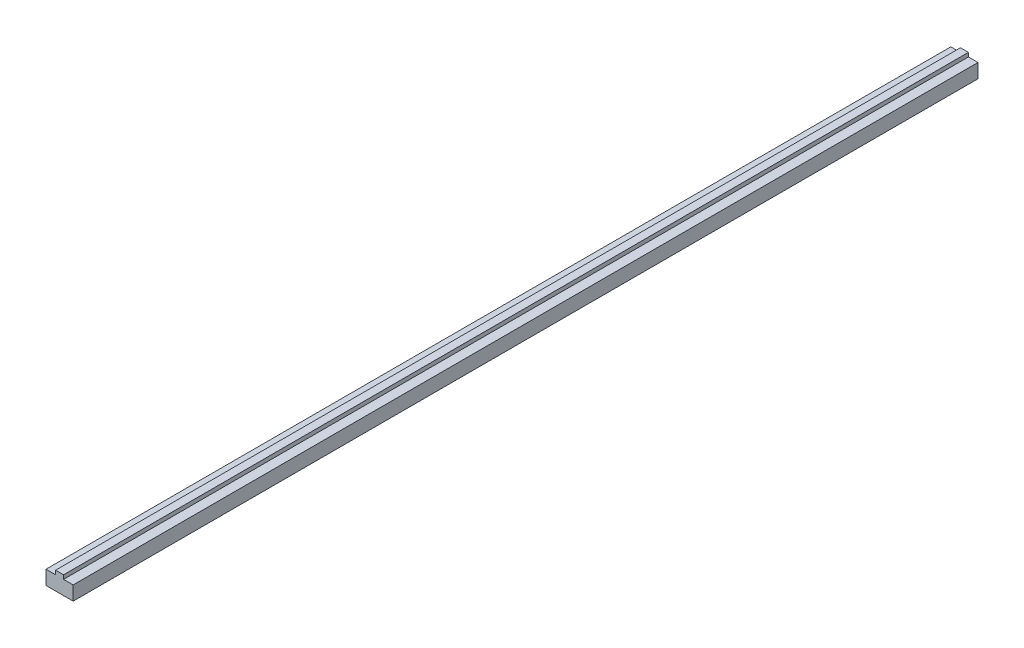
ISO-10303-21;
HEADER;
FILE_DESCRIPTION(('STEP AP214'),'2;1');
FILE_NAME('part.step','',(''),(''),'','','');
FILE_SCHEMA(('AUTOMOTIVE_DESIGN { 1 0 10303 214 1 1 1 1 }'));
ENDSEC;
DATA;
#1=APPLICATION_CONTEXT('core data for automotive mechanical design processes');
#2=APPLICATION_PROTOCOL_DEFINITION('international standard','automotive_design',2000,#1);
#3=PRODUCT_CONTEXT('',#1,'mechanical');
#4=PRODUCT('Part','Part','',(#3));
#5=PRODUCT_RELATED_PRODUCT_CATEGORY('part','',(#4));
#6=PRODUCT_DEFINITION_FORMATION('','',#4);
#7=PRODUCT_DEFINITION_CONTEXT('part definition',#1,'design');
#8=PRODUCT_DEFINITION('design','',#6,#7);
#9=PRODUCT_DEFINITION_SHAPE('','',#8);
#10=(LENGTH_UNIT() NAMED_UNIT(*) SI_UNIT(.MILLI.,.METRE.));
#11=(NAMED_UNIT(*) PLANE_ANGLE_UNIT() SI_UNIT($,.RADIAN.));
#12=(NAMED_UNIT(*) SI_UNIT($,.STERADIAN.) SOLID_ANGLE_UNIT());
#13=UNCERTAINTY_MEASURE_WITH_UNIT(LENGTH_MEASURE(1.E-05),#10,'distance_accuracy_value','');
#14=(GEOMETRIC_REPRESENTATION_CONTEXT(3) GLOBAL_UNCERTAINTY_ASSIGNED_CONTEXT((#13)) GLOBAL_UNIT_ASSIGNED_CONTEXT((#10,
#11,#12)) REPRESENTATION_CONTEXT('',''));
#15=CARTESIAN_POINT('',(0.,0.,0.));
#16=DIRECTION('',(0.,0.,1.));
#17=DIRECTION('',(1.,0.,0.));
#18=AXIS2_PLACEMENT_3D('',#15,#16,#17);
#19=CARTESIAN_POINT('',(-2.2,10.,0.));
#20=DIRECTION('',(-1.,0.,0.));
#21=DIRECTION('',(0.,0.,1.));
#22=AXIS2_PLACEMENT_3D('',#19,#20,#21);
#23=PLANE('',#22);
#24=DIRECTION('',(0.,-1.,0.));
#25=VECTOR('',#24,1.);
#26=CARTESIAN_POINT('',(-2.2,10.,500.));
#27=LINE('',#26,#25);
#28=CARTESIAN_POINT('',(-2.2,10.,500.));
#29=VERTEX_POINT('',#28);
#30=CARTESIAN_POINT('',(-2.2,7.8,500.));
#31=VERTEX_POINT('',#30);
#32=EDGE_CURVE('E112',#29,#31,#27,.T.);
#33=ORIENTED_EDGE('',*,*,#32,.F.);
#34=DIRECTION('',(0.,0.,1.));
#35=VECTOR('',#34,1.);
#36=CARTESIAN_POINT('',(-2.2,10.,0.));
#37=LINE('',#36,#35);
#38=CARTESIAN_POINT('',(-2.2,10.,0.));
#39=VERTEX_POINT('',#38);
#40=EDGE_CURVE('E9',#39,#29,#37,.T.);
#41=ORIENTED_EDGE('',*,*,#40,.F.);
#42=DIRECTION('',(0.,-1.,0.));
#43=VECTOR('',#42,1.);
#44=CARTESIAN_POINT('',(-2.2,10.,0.));
#45=LINE('',#44,#43);
#46=CARTESIAN_POINT('',(-2.2,7.8,0.));
#47=VERTEX_POINT('',#46);
#48=EDGE_CURVE('E130',#39,#47,#45,.T.);
#49=ORIENTED_EDGE('',*,*,#48,.T.);
#50=DIRECTION('',(0.,0.,1.));
#51=VECTOR('',#50,1.);
#52=CARTESIAN_POINT('',(-2.2,7.8,0.));
#53=LINE('',#52,#51);
#54=EDGE_CURVE('E17',#47,#31,#53,.T.);
#55=ORIENTED_EDGE('',*,*,#54,.T.);
#56=EDGE_LOOP('',(#33,#41,#49,#55));
#57=FACE_BOUND('',#56,.T.);
#58=ADVANCED_FACE('F14',(#57),#23,.T.);
#59=CARTESIAN_POINT('',(-2.2,10.,0.));
#60=DIRECTION('',(0.,-1.,0.));
#61=DIRECTION('',(1.,0.,0.));
#62=AXIS2_PLACEMENT_3D('',#59,#60,#61);
#63=PLANE('',#62);
#64=DIRECTION('',(1.,0.,0.));
#65=VECTOR('',#64,1.);
#66=CARTESIAN_POINT('',(-2.2,10.,500.));
#67=LINE('',#66,#65);
#68=CARTESIAN_POINT('',(2.19999999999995,10.,500.));
#69=VERTEX_POINT('',#68);
#70=EDGE_CURVE('E59',#29,#69,#67,.T.);
#71=ORIENTED_EDGE('',*,*,#70,.T.);
#72=DIRECTION('',(0.,0.,1.));
#73=VECTOR('',#72,1.);
#74=CARTESIAN_POINT('',(2.19999999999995,10.,0.));
#75=LINE('',#74,#73);
#76=CARTESIAN_POINT('',(2.19999999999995,10.,0.));
#77=VERTEX_POINT('',#76);
#78=EDGE_CURVE('E23',#77,#69,#75,.T.);
#79=ORIENTED_EDGE('',*,*,#78,.F.);
#80=DIRECTION('',(1.,0.,0.));
#81=VECTOR('',#80,1.);
#82=CARTESIAN_POINT('',(-2.2,10.,0.));
#83=LINE('',#82,#81);
#84=EDGE_CURVE('E90',#39,#77,#83,.T.);
#85=ORIENTED_EDGE('',*,*,#84,.F.);
#86=ORIENTED_EDGE('',*,*,#40,.T.);
#87=EDGE_LOOP('',(#71,#79,#85,#86));
#88=FACE_BOUND('',#87,.T.);
#89=ADVANCED_FACE('F171',(#88),#63,.F.);
#90=CARTESIAN_POINT('',(2.19999999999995,10.,0.));
#91=DIRECTION('',(-1.,0.,0.));
#92=DIRECTION('',(0.,0.,1.));
#93=AXIS2_PLACEMENT_3D('',#90,#91,#92);
#94=PLANE('',#93);
#95=DIRECTION('',(0.,-1.,0.));
#96=VECTOR('',#95,1.);
#97=CARTESIAN_POINT('',(2.19999999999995,10.,500.));
#98=LINE('',#97,#96);
#99=CARTESIAN_POINT('',(2.19999999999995,7.8,500.));
#100=VERTEX_POINT('',#99);
#101=EDGE_CURVE('E97',#69,#100,#98,.T.);
#102=ORIENTED_EDGE('',*,*,#101,.T.);
#103=DIRECTION('',(0.,0.,1.));
#104=VECTOR('',#103,1.);
#105=CARTESIAN_POINT('',(2.19999999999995,7.8,0.));
#106=LINE('',#105,#104);
#107=CARTESIAN_POINT('',(2.19999999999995,7.8,0.));
#108=VERTEX_POINT('',#107);
#109=EDGE_CURVE('E94',#108,#100,#106,.T.);
#110=ORIENTED_EDGE('',*,*,#109,.F.);
#111=DIRECTION('',(0.,-1.,0.));
#112=VECTOR('',#111,1.);
#113=CARTESIAN_POINT('',(2.19999999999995,10.,0.));
#114=LINE('',#113,#112);
#115=EDGE_CURVE('E83',#77,#108,#114,.T.);
#116=ORIENTED_EDGE('',*,*,#115,.F.);
#117=ORIENTED_EDGE('',*,*,#78,.T.);
#118=EDGE_LOOP('',(#102,#110,#116,#117));
#119=FACE_BOUND('',#118,.T.);
#120=ADVANCED_FACE('F95',(#119),#94,.F.);
#121=CARTESIAN_POINT('',(2.19999999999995,7.8,0.));
#122=DIRECTION('',(0.,-1.,0.));
#123=DIRECTION('',(0.,0.,-1.));
#124=AXIS2_PLACEMENT_3D('',#121,#122,#123);
#125=PLANE('',#124);
#126=DIRECTION('',(1.,0.,0.));
#127=VECTOR('',#126,1.);
#128=CARTESIAN_POINT('',(2.19999999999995,7.8,500.));
#129=LINE('',#128,#127);
#130=CARTESIAN_POINT('',(7.5,7.8,500.));
#131=VERTEX_POINT('',#130);
#132=EDGE_CURVE('E127',#100,#131,#129,.T.);
#133=ORIENTED_EDGE('',*,*,#132,.T.);
#134=DIRECTION('',(0.,0.,1.));
#135=VECTOR('',#134,1.);
#136=CARTESIAN_POINT('',(7.5,7.8,0.));
#137=LINE('',#136,#135);
#138=CARTESIAN_POINT('',(7.5,7.8,0.));
#139=VERTEX_POINT('',#138);
#140=EDGE_CURVE('E100',#139,#131,#137,.T.);
#141=ORIENTED_EDGE('',*,*,#140,.F.);
#142=DIRECTION('',(1.,0.,0.));
#143=VECTOR('',#142,1.);
#144=CARTESIAN_POINT('',(2.19999999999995,7.8,0.));
#145=LINE('',#144,#143);
#146=EDGE_CURVE('E88',#108,#139,#145,.T.);
#147=ORIENTED_EDGE('',*,*,#146,.F.);
#148=ORIENTED_EDGE('',*,*,#109,.T.);
#149=EDGE_LOOP('',(#133,#141,#147,#148));
#150=FACE_BOUND('',#149,.T.);
#151=ADVANCED_FACE('F102',(#150),#125,.F.);
#152=CARTESIAN_POINT('',(7.5,7.8,0.));
#153=DIRECTION('',(-1.,0.,0.));
#154=DIRECTION('',(0.,0.,1.));
#155=AXIS2_PLACEMENT_3D('',#152,#153,#154);
#156=PLANE('',#155);
#157=DIRECTION('',(0.,-1.,0.));
#158=VECTOR('',#157,1.);
#159=CARTESIAN_POINT('',(7.5,7.8,500.));
#160=LINE('',#159,#158);
#161=CARTESIAN_POINT('',(7.5,0.,500.));
#162=VERTEX_POINT('',#161);
#163=EDGE_CURVE('E124',#131,#162,#160,.T.);
#164=ORIENTED_EDGE('',*,*,#163,.T.);
#165=DIRECTION('',(0.,0.,1.));
#166=VECTOR('',#165,1.);
#167=CARTESIAN_POINT('',(7.5,0.,0.));
#168=LINE('',#167,#166);
#169=CARTESIAN_POINT('',(7.5,0.,0.));
#170=VERTEX_POINT('',#169);
#171=EDGE_CURVE('E134',#170,#162,#168,.T.);
#172=ORIENTED_EDGE('',*,*,#171,.F.);
#173=DIRECTION('',(0.,-1.,0.));
#174=VECTOR('',#173,1.);
#175=CARTESIAN_POINT('',(7.5,7.8,0.));
#176=LINE('',#175,#174);
#177=EDGE_CURVE('E105',#139,#170,#176,.T.);
#178=ORIENTED_EDGE('',*,*,#177,.F.);
#179=ORIENTED_EDGE('',*,*,#140,.T.);
#180=EDGE_LOOP('',(#164,#172,#178,#179));
#181=FACE_BOUND('',#180,.T.);
#182=ADVANCED_FACE('F144',(#181),#156,.F.);
#183=CARTESIAN_POINT('',(-7.5,0.,0.));
#184=DIRECTION('',(0.,-1.,0.));
#185=DIRECTION('',(0.,0.,-1.));
#186=AXIS2_PLACEMENT_3D('',#183,#184,#185);
#187=PLANE('',#186);
#188=DIRECTION('',(1.,0.,0.));
#189=VECTOR('',#188,1.);
#190=CARTESIAN_POINT('',(-7.5,0.,500.));
#191=LINE('',#190,#189);
#192=CARTESIAN_POINT('',(-7.5,0.,500.));
#193=VERTEX_POINT('',#192);
#194=EDGE_CURVE('E121',#193,#162,#191,.T.);
#195=ORIENTED_EDGE('',*,*,#194,.F.);
#196=DIRECTION('',(0.,0.,1.));
#197=VECTOR('',#196,1.);
#198=CARTESIAN_POINT('',(-7.5,0.,0.));
#199=LINE('',#198,#197);
#200=CARTESIAN_POINT('',(-7.5,0.,0.));
#201=VERTEX_POINT('',#200);
#202=EDGE_CURVE('E136',#201,#193,#199,.T.);
#203=ORIENTED_EDGE('',*,*,#202,.F.);
#204=DIRECTION('',(1.,0.,0.));
#205=VECTOR('',#204,1.);
#206=CARTESIAN_POINT('',(-7.5,0.,0.));
#207=LINE('',#206,#205);
#208=EDGE_CURVE('E107',#201,#170,#207,.T.);
#209=ORIENTED_EDGE('',*,*,#208,.T.);
#210=ORIENTED_EDGE('',*,*,#171,.T.);
#211=EDGE_LOOP('',(#195,#203,#209,#210));
#212=FACE_BOUND('',#211,.T.);
#213=ADVANCED_FACE('F159',(#212),#187,.T.);
#214=CARTESIAN_POINT('',(-7.5,7.8,0.));
#215=DIRECTION('',(-1.,0.,0.));
#216=DIRECTION('',(0.,0.,1.));
#217=AXIS2_PLACEMENT_3D('',#214,#215,#216);
#218=PLANE('',#217);
#219=DIRECTION('',(0.,-1.,0.));
#220=VECTOR('',#219,1.);
#221=CARTESIAN_POINT('',(-7.5,7.8,500.));
#222=LINE('',#221,#220);
#223=CARTESIAN_POINT('',(-7.5,7.8,500.));
#224=VERTEX_POINT('',#223);
#225=EDGE_CURVE('E118',#224,#193,#222,.T.);
#226=ORIENTED_EDGE('',*,*,#225,.F.);
#227=DIRECTION('',(0.,0.,1.));
#228=VECTOR('',#227,1.);
#229=CARTESIAN_POINT('',(-7.5,7.8,0.));
#230=LINE('',#229,#228);
#231=CARTESIAN_POINT('',(-7.5,7.8,0.));
#232=VERTEX_POINT('',#231);
#233=EDGE_CURVE('E137',#232,#224,#230,.T.);
#234=ORIENTED_EDGE('',*,*,#233,.F.);
#235=DIRECTION('',(0.,-1.,0.));
#236=VECTOR('',#235,1.);
#237=CARTESIAN_POINT('',(-7.5,7.8,0.));
#238=LINE('',#237,#236);
#239=EDGE_CURVE('E150',#232,#201,#238,.T.);
#240=ORIENTED_EDGE('',*,*,#239,.T.);
#241=ORIENTED_EDGE('',*,*,#202,.T.);
#242=EDGE_LOOP('',(#226,#234,#240,#241));
#243=FACE_BOUND('',#242,.T.);
#244=ADVANCED_FACE('F153',(#243),#218,.T.);
#245=CARTESIAN_POINT('',(-2.2,7.8,0.));
#246=DIRECTION('',(0.,1.,0.));
#247=DIRECTION('',(-1.,0.,0.));
#248=AXIS2_PLACEMENT_3D('',#245,#246,#247);
#249=PLANE('',#248);
#250=DIRECTION('',(-1.,0.,0.));
#251=VECTOR('',#250,1.);
#252=CARTESIAN_POINT('',(-2.2,7.8,500.));
#253=LINE('',#252,#251);
#254=EDGE_CURVE('E115',#31,#224,#253,.T.);
#255=ORIENTED_EDGE('',*,*,#254,.F.);
#256=ORIENTED_EDGE('',*,*,#54,.F.);
#257=DIRECTION('',(-1.,0.,0.));
#258=VECTOR('',#257,1.);
#259=CARTESIAN_POINT('',(-2.2,7.8,0.));
#260=LINE('',#259,#258);
#261=EDGE_CURVE('E155',#47,#232,#260,.T.);
#262=ORIENTED_EDGE('',*,*,#261,.T.);
#263=ORIENTED_EDGE('',*,*,#233,.T.);
#264=EDGE_LOOP('',(#255,#256,#262,#263));
#265=FACE_BOUND('',#264,.T.);
#266=ADVANCED_FACE('F139',(#265),#249,.T.);
#267=CARTESIAN_POINT('',(-2.2,0.,0.));
#268=DIRECTION('',(0.,0.,1.));
#269=DIRECTION('',(1.,0.,0.));
#270=AXIS2_PLACEMENT_3D('',#267,#268,#269);
#271=PLANE('',#270);
#272=ORIENTED_EDGE('',*,*,#48,.F.);
#273=ORIENTED_EDGE('',*,*,#84,.T.);
#274=ORIENTED_EDGE('',*,*,#115,.T.);
#275=ORIENTED_EDGE('',*,*,#146,.T.);
#276=ORIENTED_EDGE('',*,*,#177,.T.);
#277=ORIENTED_EDGE('',*,*,#208,.F.);
#278=ORIENTED_EDGE('',*,*,#239,.F.);
#279=ORIENTED_EDGE('',*,*,#261,.F.);
#280=EDGE_LOOP('',(#272,#273,#274,#275,#276,#277,#278,#279));
#281=FACE_BOUND('',#280,.T.);
#282=ADVANCED_FACE('F86',(#281),#271,.F.);
#283=CARTESIAN_POINT('',(-2.2,0.,500.));
#284=DIRECTION('',(0.,0.,1.));
#285=DIRECTION('',(1.,0.,0.));
#286=AXIS2_PLACEMENT_3D('',#283,#284,#285);
#287=PLANE('',#286);
#288=ORIENTED_EDGE('',*,*,#32,.T.);
#289=ORIENTED_EDGE('',*,*,#254,.T.);
#290=ORIENTED_EDGE('',*,*,#225,.T.);
#291=ORIENTED_EDGE('',*,*,#194,.T.);
#292=ORIENTED_EDGE('',*,*,#163,.F.);
#293=ORIENTED_EDGE('',*,*,#132,.F.);
#294=ORIENTED_EDGE('',*,*,#101,.F.);
#295=ORIENTED_EDGE('',*,*,#70,.F.);
#296=EDGE_LOOP('',(#288,#289,#290,#291,#292,#293,#294,#295));
#297=FACE_BOUND('',#296,.T.);
#298=ADVANCED_FACE('F141',(#297),#287,.T.);
#299=CLOSED_SHELL('',(#58,#89,#120,#151,#182,#213,#244,#266,#282,#298));
#300=MANIFOLD_SOLID_BREP('B1',#299);
#301=ADVANCED_BREP_SHAPE_REPRESENTATION('',(#18,#300),#14);
#302=SHAPE_DEFINITION_REPRESENTATION(#9,#301);
ENDSEC;
END-ISO-10303-21;
